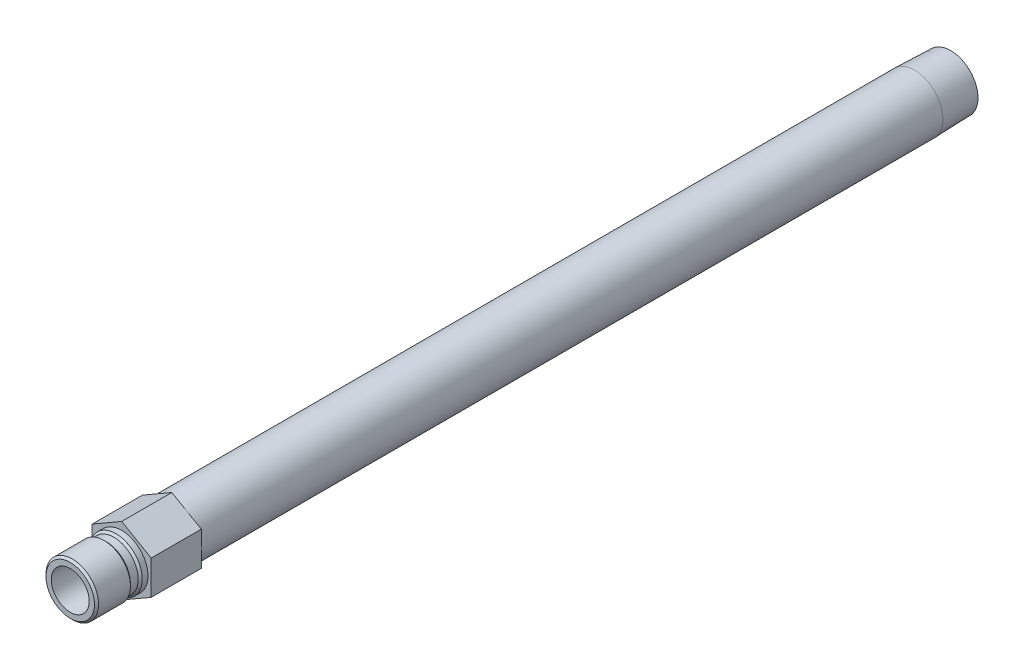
from build123d import *

# Parameters (mm, degrees)
SKETCH2_R           = 7.112
BOSS_EXTRUDE1_DEPTH = 18.796


with BuildPart() as part:
    # Sketch1 → Revolve1 (revolve)
    with BuildSketch(Plane(origin=(0, 0, 0), x_dir=(0, 0, -1), z_dir=(1, 0, 0))):
        Polygon((-19.304, 7.112), (-19.304, 9.0932), (-18.542, 9.8552), (-6.5786, 9.8552), (-5.8166, 9.0932), (-2.921, 9.0932), (-2.159, 9.8552), (0, 9.8552), (0, 10.668), (297.3324, 10.668), (310.896, 10.244140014), (310.896, 7.8994), (-1.105331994, 7.8994), (-1.524, 7.112), align=None)
    revolve(axis=Axis((0, 0, 0), (0, 0, 1)))

    # Sketch2 → Boss-Extrude1 (add)
    with BuildSketch(Plane.XY):
        Polygon((-11.049, 6.379143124), (-11.049, -6.379143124), (0, -12.758286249), (11.049, -6.379143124), (11.049, 6.379143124), (0, 12.758286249), align=None)
        with Locations(Location((0, 0, 0), (0, 0, 90))):
            Circle(SKETCH2_R, mode=Mode.SUBTRACT)
    extrude(amount=-BOSS_EXTRUDE1_DEPTH)


solid = part.part
